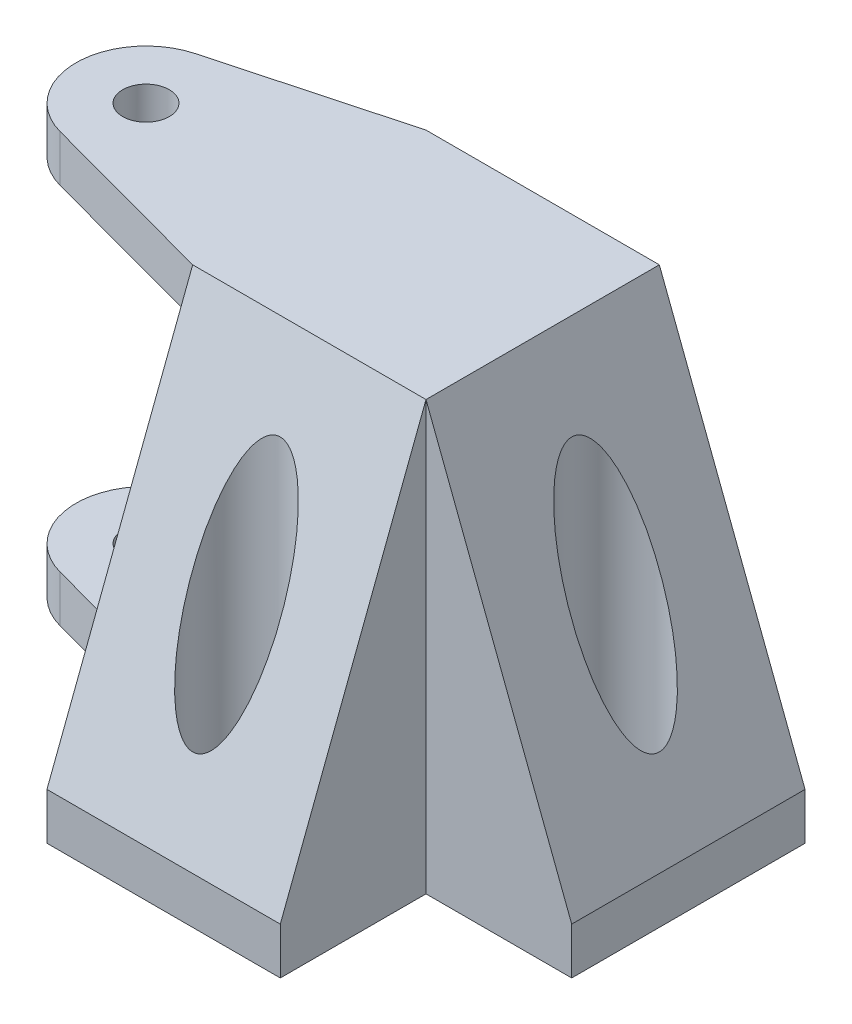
ISO-10303-21;
HEADER;
FILE_DESCRIPTION(('STEP AP214'),'2;1');
FILE_NAME('part.step','',(''),(''),'','','');
FILE_SCHEMA(('AUTOMOTIVE_DESIGN { 1 0 10303 214 1 1 1 1 }'));
ENDSEC;
DATA;
#1=APPLICATION_CONTEXT('core data for automotive mechanical design processes');
#2=APPLICATION_PROTOCOL_DEFINITION('international standard','automotive_design',2000,#1);
#3=PRODUCT_CONTEXT('',#1,'mechanical');
#4=PRODUCT('Part','Part','',(#3));
#5=PRODUCT_RELATED_PRODUCT_CATEGORY('part','',(#4));
#6=PRODUCT_DEFINITION_FORMATION('','',#4);
#7=PRODUCT_DEFINITION_CONTEXT('part definition',#1,'design');
#8=PRODUCT_DEFINITION('design','',#6,#7);
#9=PRODUCT_DEFINITION_SHAPE('','',#8);
#10=(LENGTH_UNIT() NAMED_UNIT(*) SI_UNIT(.MILLI.,.METRE.));
#11=(NAMED_UNIT(*) PLANE_ANGLE_UNIT() SI_UNIT($,.RADIAN.));
#12=(NAMED_UNIT(*) SI_UNIT($,.STERADIAN.) SOLID_ANGLE_UNIT());
#13=UNCERTAINTY_MEASURE_WITH_UNIT(LENGTH_MEASURE(1.E-05),#10,'distance_accuracy_value','');
#14=(GEOMETRIC_REPRESENTATION_CONTEXT(3) GLOBAL_UNCERTAINTY_ASSIGNED_CONTEXT((#13)) GLOBAL_UNIT_ASSIGNED_CONTEXT((#10,
#11,#12)) REPRESENTATION_CONTEXT('',''));
#15=CARTESIAN_POINT('',(0.,0.,0.));
#16=DIRECTION('',(0.,0.,1.));
#17=DIRECTION('',(1.,0.,0.));
#18=AXIS2_PLACEMENT_3D('',#15,#16,#17);
#19=CARTESIAN_POINT('',(-20.,0.,52.4890829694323));
#20=DIRECTION('',(0.,1.,0.));
#21=DIRECTION('',(0.,0.,1.));
#22=AXIS2_PLACEMENT_3D('',#19,#20,#21);
#23=CYLINDRICAL_SURFACE('',#22,4.);
#24=CARTESIAN_POINT('',(-20.,0.,52.4890829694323));
#25=DIRECTION('',(0.,1.,0.));
#26=DIRECTION('',(0.,0.,1.));
#27=AXIS2_PLACEMENT_3D('',#24,#25,#26);
#28=CIRCLE('',#27,4.);
#29=CARTESIAN_POINT('',(-20.,0.,56.4890829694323));
#30=VERTEX_POINT('',#29);
#31=EDGE_CURVE('E284',#30,#30,#28,.T.);
#32=ORIENTED_EDGE('',*,*,#31,.F.);
#33=EDGE_LOOP('',(#32));
#34=FACE_BOUND('',#33,.T.);
#35=CARTESIAN_POINT('',(-20.,5.,52.4890829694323));
#36=DIRECTION('',(0.,1.,0.));
#37=DIRECTION('',(0.,0.,1.));
#38=AXIS2_PLACEMENT_3D('',#35,#36,#37);
#39=CIRCLE('',#38,4.);
#40=CARTESIAN_POINT('',(-20.,5.,56.4890829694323));
#41=VERTEX_POINT('',#40);
#42=EDGE_CURVE('E268',#41,#41,#39,.F.);
#43=ORIENTED_EDGE('',*,*,#42,.F.);
#44=EDGE_LOOP('',(#43));
#45=FACE_BOUND('',#44,.T.);
#46=ADVANCED_FACE('F49',(#34,#45),#23,.F.);
#47=CARTESIAN_POINT('',(12.4890829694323,0.,20.));
#48=DIRECTION('',(0.,1.,0.));
#49=DIRECTION('',(0.,0.,1.));
#50=AXIS2_PLACEMENT_3D('',#47,#48,#49);
#51=CYLINDRICAL_SURFACE('',#50,4.);
#52=CARTESIAN_POINT('',(12.4890829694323,0.,20.));
#53=DIRECTION('',(0.,1.,0.));
#54=DIRECTION('',(0.,0.,1.));
#55=AXIS2_PLACEMENT_3D('',#52,#53,#54);
#56=CIRCLE('',#55,4.);
#57=CARTESIAN_POINT('',(12.4890829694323,0.,24.));
#58=VERTEX_POINT('',#57);
#59=EDGE_CURVE('E264',#58,#58,#56,.T.);
#60=ORIENTED_EDGE('',*,*,#59,.F.);
#61=EDGE_LOOP('',(#60));
#62=FACE_BOUND('',#61,.T.);
#63=CARTESIAN_POINT('',(12.4890829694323,5.,20.));
#64=DIRECTION('',(0.,1.,0.));
#65=DIRECTION('',(0.,0.,1.));
#66=AXIS2_PLACEMENT_3D('',#63,#64,#65);
#67=CIRCLE('',#66,4.);
#68=CARTESIAN_POINT('',(12.4890829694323,5.,24.));
#69=VERTEX_POINT('',#68);
#70=EDGE_CURVE('E265',#69,#69,#67,.F.);
#71=ORIENTED_EDGE('',*,*,#70,.F.);
#72=EDGE_LOOP('',(#71));
#73=FACE_BOUND('',#72,.T.);
#74=ADVANCED_FACE('F316',(#62,#73),#51,.F.);
#75=CARTESIAN_POINT('',(0.,0.,40.));
#76=DIRECTION('',(0.,0.,-1.));
#77=DIRECTION('',(-1.,0.,0.));
#78=AXIS2_PLACEMENT_3D('',#75,#76,#77);
#79=PLANE('',#78);
#80=DIRECTION('',(0.,1.,0.));
#81=VECTOR('',#80,1.);
#82=CARTESIAN_POINT('',(0.,73.3918284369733,40.));
#83=LINE('',#82,#81);
#84=CARTESIAN_POINT('',(0.,0.,40.));
#85=VERTEX_POINT('',#84);
#86=CARTESIAN_POINT('',(0.,73.3918284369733,40.));
#87=VERTEX_POINT('',#86);
#88=EDGE_CURVE('E66',#85,#87,#83,.T.);
#89=ORIENTED_EDGE('',*,*,#88,.F.);
#90=DIRECTION('',(1.,0.,0.));
#91=VECTOR('',#90,1.);
#92=CARTESIAN_POINT('',(0.,0.,40.));
#93=LINE('',#92,#91);
#94=CARTESIAN_POINT('',(24.9781659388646,0.,40.));
#95=VERTEX_POINT('',#94);
#96=EDGE_CURVE('E228',#85,#95,#93,.T.);
#97=ORIENTED_EDGE('',*,*,#96,.T.);
#98=DIRECTION('',(0.,1.,0.));
#99=VECTOR('',#98,1.);
#100=CARTESIAN_POINT('',(24.9781659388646,8.,40.));
#101=LINE('',#100,#99);
#102=CARTESIAN_POINT('',(24.9781659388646,8.,40.));
#103=VERTEX_POINT('',#102);
#104=EDGE_CURVE('E230',#95,#103,#101,.T.);
#105=ORIENTED_EDGE('',*,*,#104,.T.);
#106=DIRECTION('',(-0.35683094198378,0.934168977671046,0.));
#107=VECTOR('',#106,1.);
#108=CARTESIAN_POINT('',(0.,73.3918284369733,40.));
#109=LINE('',#108,#107);
#110=EDGE_CURVE('E233',#103,#87,#109,.T.);
#111=ORIENTED_EDGE('',*,*,#110,.T.);
#112=EDGE_LOOP('',(#89,#97,#105,#111));
#113=FACE_BOUND('',#112,.T.);
#114=ADVANCED_FACE('F322',(#113),#79,.F.);
#115=CARTESIAN_POINT('',(-40.,0.,40.));
#116=DIRECTION('',(0.260963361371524,0.,-0.965348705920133));
#117=DIRECTION('',(-0.965348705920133,0.,-0.260963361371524));
#118=AXIS2_PLACEMENT_3D('',#115,#116,#117);
#119=PLANE('',#118);
#120=DIRECTION('',(-0.965348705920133,0.,-0.260963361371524));
#121=VECTOR('',#120,1.);
#122=CARTESIAN_POINT('',(-40.,65.3918284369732,40.));
#123=LINE('',#122,#121);
#124=CARTESIAN_POINT('',(-40.,65.3918284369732,40.));
#125=VERTEX_POINT('',#124);
#126=CARTESIAN_POINT('',(-71.1315603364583,65.3918284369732,31.5841844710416));
#127=VERTEX_POINT('',#126);
#128=EDGE_CURVE('E201',#125,#127,#123,.T.);
#129=ORIENTED_EDGE('',*,*,#128,.F.);
#130=DIRECTION('',(0.,-1.,0.));
#131=VECTOR('',#130,1.);
#132=CARTESIAN_POINT('',(-40.,0.,40.));
#133=LINE('',#132,#131);
#134=CARTESIAN_POINT('',(-40.,73.3918284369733,40.));
#135=VERTEX_POINT('',#134);
#136=EDGE_CURVE('E237',#135,#125,#133,.T.);
#137=ORIENTED_EDGE('',*,*,#136,.F.);
#138=DIRECTION('',(-0.965348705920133,0.,-0.260963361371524));
#139=VECTOR('',#138,1.);
#140=CARTESIAN_POINT('',(-40.,73.3918284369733,40.));
#141=LINE('',#140,#139);
#142=CARTESIAN_POINT('',(-71.1315603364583,73.3918284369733,31.5841844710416));
#143=VERTEX_POINT('',#142);
#144=EDGE_CURVE('E203',#135,#143,#141,.T.);
#145=ORIENTED_EDGE('',*,*,#144,.T.);
#146=DIRECTION('',(0.,1.,0.));
#147=VECTOR('',#146,1.);
#148=CARTESIAN_POINT('',(-71.1315603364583,0.,31.5841844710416));
#149=LINE('',#148,#147);
#150=EDGE_CURVE('E223',#127,#143,#149,.T.);
#151=ORIENTED_EDGE('',*,*,#150,.F.);
#152=EDGE_LOOP('',(#129,#137,#145,#151));
#153=FACE_BOUND('',#152,.T.);
#154=ADVANCED_FACE('F360',(#153),#119,.F.);
#155=DIRECTION('',(0.965348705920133,0.,0.260963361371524));
#156=VECTOR('',#155,1.);
#157=CARTESIAN_POINT('',(-40.,8.,40.));
#158=LINE('',#157,#156);
#159=CARTESIAN_POINT('',(-71.1315603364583,8.,31.5841844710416));
#160=VERTEX_POINT('',#159);
#161=CARTESIAN_POINT('',(-40.,8.,40.));
#162=VERTEX_POINT('',#161);
#163=EDGE_CURVE('E197',#160,#162,#158,.T.);
#164=ORIENTED_EDGE('',*,*,#163,.F.);
#165=CARTESIAN_POINT('',(-71.1315603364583,0.,31.5841844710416));
#166=VERTEX_POINT('',#165);
#167=EDGE_CURVE('E224',#166,#160,#149,.T.);
#168=ORIENTED_EDGE('',*,*,#167,.F.);
#169=DIRECTION('',(-0.965348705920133,0.,-0.260963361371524));
#170=VECTOR('',#169,1.);
#171=CARTESIAN_POINT('',(-40.,0.,40.));
#172=LINE('',#171,#170);
#173=CARTESIAN_POINT('',(-40.,0.,40.));
#174=VERTEX_POINT('',#173);
#175=EDGE_CURVE('E204',#174,#166,#172,.T.);
#176=ORIENTED_EDGE('',*,*,#175,.F.);
#177=EDGE_CURVE('E236',#162,#174,#133,.T.);
#178=ORIENTED_EDGE('',*,*,#177,.F.);
#179=EDGE_LOOP('',(#164,#168,#176,#178));
#180=FACE_BOUND('',#179,.T.);
#181=ADVANCED_FACE('F358',(#180),#119,.F.);
#182=CARTESIAN_POINT('',(-68.,0.,20.));
#183=DIRECTION('',(0.,1.,0.));
#184=DIRECTION('',(0.,0.,1.));
#185=AXIS2_PLACEMENT_3D('',#182,#183,#184);
#186=CYLINDRICAL_SURFACE('',#185,12.);
#187=DIRECTION('',(0.,1.,0.));
#188=VECTOR('',#187,1.);
#189=CARTESIAN_POINT('',(-71.1315603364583,0.,8.41581552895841));
#190=LINE('',#189,#188);
#191=CARTESIAN_POINT('',(-71.1315603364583,65.3918284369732,8.41581552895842));
#192=VERTEX_POINT('',#191);
#193=CARTESIAN_POINT('',(-71.1315603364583,73.3918284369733,8.41581552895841));
#194=VERTEX_POINT('',#193);
#195=EDGE_CURVE('E212',#192,#194,#190,.T.);
#196=ORIENTED_EDGE('',*,*,#195,.F.);
#197=CARTESIAN_POINT('',(-68.,65.3918284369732,20.));
#198=DIRECTION('',(0.,-1.,0.));
#199=DIRECTION('',(0.,0.,-1.));
#200=AXIS2_PLACEMENT_3D('',#197,#198,#199);
#201=CIRCLE('',#200,12.);
#202=EDGE_CURVE('E199',#127,#192,#201,.T.);
#203=ORIENTED_EDGE('',*,*,#202,.F.);
#204=ORIENTED_EDGE('',*,*,#150,.T.);
#205=CARTESIAN_POINT('',(-68.,73.3918284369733,20.));
#206=DIRECTION('',(0.,-1.,0.));
#207=DIRECTION('',(0.,0.,-1.));
#208=AXIS2_PLACEMENT_3D('',#205,#206,#207);
#209=CIRCLE('',#208,12.);
#210=EDGE_CURVE('E215',#143,#194,#209,.T.);
#211=ORIENTED_EDGE('',*,*,#210,.T.);
#212=EDGE_LOOP('',(#196,#203,#204,#211));
#213=FACE_BOUND('',#212,.T.);
#214=ADVANCED_FACE('F355',(#213),#186,.T.);
#215=CARTESIAN_POINT('',(-68.,8.,20.));
#216=DIRECTION('',(0.,1.,0.));
#217=DIRECTION('',(-1.,0.,0.));
#218=AXIS2_PLACEMENT_3D('',#215,#216,#217);
#219=CIRCLE('',#218,12.);
#220=CARTESIAN_POINT('',(-71.1315603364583,8.,8.41581552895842));
#221=VERTEX_POINT('',#220);
#222=EDGE_CURVE('E195',#221,#160,#219,.T.);
#223=ORIENTED_EDGE('',*,*,#222,.F.);
#224=CARTESIAN_POINT('',(-71.1315603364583,0.,8.41581552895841));
#225=VERTEX_POINT('',#224);
#226=EDGE_CURVE('E220',#225,#221,#190,.T.);
#227=ORIENTED_EDGE('',*,*,#226,.F.);
#228=CARTESIAN_POINT('',(-68.,0.,20.));
#229=DIRECTION('',(0.,-1.,0.));
#230=DIRECTION('',(0.,0.,-1.));
#231=AXIS2_PLACEMENT_3D('',#228,#229,#230);
#232=CIRCLE('',#231,12.);
#233=EDGE_CURVE('E206',#166,#225,#232,.T.);
#234=ORIENTED_EDGE('',*,*,#233,.F.);
#235=ORIENTED_EDGE('',*,*,#167,.T.);
#236=EDGE_LOOP('',(#223,#227,#234,#235));
#237=FACE_BOUND('',#236,.T.);
#238=ADVANCED_FACE('F353',(#237),#186,.T.);
#239=CARTESIAN_POINT('',(-40.,0.,0.));
#240=DIRECTION('',(-0.260963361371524,0.,-0.965348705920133));
#241=DIRECTION('',(-0.965348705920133,0.,0.260963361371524));
#242=AXIS2_PLACEMENT_3D('',#239,#240,#241);
#243=PLANE('',#242);
#244=DIRECTION('',(0.,-1.,0.));
#245=VECTOR('',#244,1.);
#246=CARTESIAN_POINT('',(-40.,0.,0.));
#247=LINE('',#246,#245);
#248=CARTESIAN_POINT('',(-40.,73.3918284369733,0.));
#249=VERTEX_POINT('',#248);
#250=CARTESIAN_POINT('',(-40.,65.3918284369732,0.));
#251=VERTEX_POINT('',#250);
#252=EDGE_CURVE('E247',#249,#251,#247,.T.);
#253=ORIENTED_EDGE('',*,*,#252,.T.);
#254=DIRECTION('',(-0.965348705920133,0.,0.260963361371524));
#255=VECTOR('',#254,1.);
#256=CARTESIAN_POINT('',(-40.,65.3918284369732,0.));
#257=LINE('',#256,#255);
#258=EDGE_CURVE('E11',#251,#192,#257,.T.);
#259=ORIENTED_EDGE('',*,*,#258,.T.);
#260=ORIENTED_EDGE('',*,*,#195,.T.);
#261=DIRECTION('',(-0.965348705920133,0.,0.260963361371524));
#262=VECTOR('',#261,1.);
#263=CARTESIAN_POINT('',(-40.,73.3918284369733,0.));
#264=LINE('',#263,#262);
#265=EDGE_CURVE('E207',#249,#194,#264,.T.);
#266=ORIENTED_EDGE('',*,*,#265,.F.);
#267=EDGE_LOOP('',(#253,#259,#260,#266));
#268=FACE_BOUND('',#267,.T.);
#269=ADVANCED_FACE('F349',(#268),#243,.T.);
#270=ORIENTED_EDGE('',*,*,#226,.T.);
#271=DIRECTION('',(0.965348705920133,0.,-0.260963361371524));
#272=VECTOR('',#271,1.);
#273=CARTESIAN_POINT('',(-40.,8.,0.));
#274=LINE('',#273,#272);
#275=CARTESIAN_POINT('',(-40.,8.,0.));
#276=VERTEX_POINT('',#275);
#277=EDGE_CURVE('E58',#221,#276,#274,.T.);
#278=ORIENTED_EDGE('',*,*,#277,.T.);
#279=CARTESIAN_POINT('',(-40.,0.,0.));
#280=VERTEX_POINT('',#279);
#281=EDGE_CURVE('E246',#276,#280,#247,.T.);
#282=ORIENTED_EDGE('',*,*,#281,.T.);
#283=DIRECTION('',(-0.965348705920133,0.,0.260963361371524));
#284=VECTOR('',#283,1.);
#285=CARTESIAN_POINT('',(-40.,0.,0.));
#286=LINE('',#285,#284);
#287=EDGE_CURVE('E209',#280,#225,#286,.T.);
#288=ORIENTED_EDGE('',*,*,#287,.T.);
#289=EDGE_LOOP('',(#270,#278,#282,#288));
#290=FACE_BOUND('',#289,.T.);
#291=ADVANCED_FACE('F352',(#290),#243,.T.);
#292=CARTESIAN_POINT('',(24.9781659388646,8.,40.));
#293=DIRECTION('',(-1.,0.,0.));
#294=DIRECTION('',(0.,-1.,0.));
#295=AXIS2_PLACEMENT_3D('',#292,#293,#294);
#296=PLANE('',#295);
#297=DIRECTION('',(0.,1.,0.));
#298=VECTOR('',#297,1.);
#299=CARTESIAN_POINT('',(24.9781659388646,8.,0.));
#300=LINE('',#299,#298);
#301=CARTESIAN_POINT('',(24.9781659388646,0.,0.));
#302=VERTEX_POINT('',#301);
#303=CARTESIAN_POINT('',(24.9781659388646,8.,0.));
#304=VERTEX_POINT('',#303);
#305=EDGE_CURVE('E227',#302,#304,#300,.T.);
#306=ORIENTED_EDGE('',*,*,#305,.T.);
#307=DIRECTION('',(0.,0.,-1.));
#308=VECTOR('',#307,1.);
#309=CARTESIAN_POINT('',(24.9781659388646,8.,40.));
#310=LINE('',#309,#308);
#311=EDGE_CURVE('E253',#103,#304,#310,.T.);
#312=ORIENTED_EDGE('',*,*,#311,.F.);
#313=ORIENTED_EDGE('',*,*,#104,.F.);
#314=DIRECTION('',(0.,0.,-1.));
#315=VECTOR('',#314,1.);
#316=CARTESIAN_POINT('',(24.9781659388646,0.,40.));
#317=LINE('',#316,#315);
#318=EDGE_CURVE('E256',#95,#302,#317,.T.);
#319=ORIENTED_EDGE('',*,*,#318,.T.);
#320=EDGE_LOOP('',(#306,#312,#313,#319));
#321=FACE_BOUND('',#320,.T.);
#322=ADVANCED_FACE('F51',(#321),#296,.F.);
#323=CARTESIAN_POINT('',(0.,73.3918284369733,40.));
#324=DIRECTION('',(-0.934168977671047,-0.35683094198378,0.));
#325=DIRECTION('',(0.35683094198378,-0.934168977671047,0.));
#326=AXIS2_PLACEMENT_3D('',#323,#324,#325);
#327=PLANE('',#326);
#328=CARTESIAN_POINT('',(12.4890829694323,40.6959142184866,20.));
#329=DIRECTION('',(-0.934168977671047,-0.35683094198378,0.));
#330=DIRECTION('',(0.35683094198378,-0.934168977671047,0.));
#331=AXIS2_PLACEMENT_3D('',#328,#329,#330);
#332=ELLIPSE('',#331,21.0183566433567,7.5);
#333=CARTESIAN_POINT('',(19.9890829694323,21.0612174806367,20.));
#334=VERTEX_POINT('',#333);
#335=EDGE_CURVE('E53',#334,#334,#332,.F.);
#336=ORIENTED_EDGE('',*,*,#335,.F.);
#337=EDGE_LOOP('',(#336));
#338=FACE_BOUND('',#337,.T.);
#339=DIRECTION('',(-0.35683094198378,0.934168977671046,0.));
#340=VECTOR('',#339,1.);
#341=CARTESIAN_POINT('',(0.,73.3918284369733,0.));
#342=LINE('',#341,#340);
#343=CARTESIAN_POINT('',(0.,73.3918284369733,0.));
#344=VERTEX_POINT('',#343);
#345=EDGE_CURVE('E241',#304,#344,#342,.T.);
#346=ORIENTED_EDGE('',*,*,#345,.T.);
#347=DIRECTION('',(0.,0.,-1.));
#348=VECTOR('',#347,1.);
#349=CARTESIAN_POINT('',(0.,73.3918284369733,40.));
#350=LINE('',#349,#348);
#351=EDGE_CURVE('E239',#87,#344,#350,.T.);
#352=ORIENTED_EDGE('',*,*,#351,.F.);
#353=ORIENTED_EDGE('',*,*,#110,.F.);
#354=ORIENTED_EDGE('',*,*,#311,.T.);
#355=EDGE_LOOP('',(#346,#352,#353,#354));
#356=FACE_BOUND('',#355,.T.);
#357=ADVANCED_FACE('F375',(#338,#356),#327,.F.);
#358=CARTESIAN_POINT('',(-40.,73.3918284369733,40.));
#359=DIRECTION('',(0.,-1.,0.));
#360=DIRECTION('',(0.,0.,-1.));
#361=AXIS2_PLACEMENT_3D('',#358,#359,#360);
#362=PLANE('',#361);
#363=CARTESIAN_POINT('',(-68.,73.3918284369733,20.));
#364=DIRECTION('',(0.,1.,0.));
#365=DIRECTION('',(0.,0.,1.));
#366=AXIS2_PLACEMENT_3D('',#363,#364,#365);
#367=CIRCLE('',#366,4.00000000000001);
#368=CARTESIAN_POINT('',(-68.,73.3918284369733,24.));
#369=VERTEX_POINT('',#368);
#370=EDGE_CURVE('E280',#369,#369,#367,.T.);
#371=ORIENTED_EDGE('',*,*,#370,.F.);
#372=EDGE_LOOP('',(#371));
#373=FACE_BOUND('',#372,.T.);
#374=DIRECTION('',(-1.,0.,0.));
#375=VECTOR('',#374,1.);
#376=CARTESIAN_POINT('',(-40.,73.3918284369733,0.));
#377=LINE('',#376,#375);
#378=EDGE_CURVE('E243',#344,#249,#377,.T.);
#379=ORIENTED_EDGE('',*,*,#378,.T.);
#380=ORIENTED_EDGE('',*,*,#265,.T.);
#381=ORIENTED_EDGE('',*,*,#210,.F.);
#382=ORIENTED_EDGE('',*,*,#144,.F.);
#383=DIRECTION('',(-1.,0.,0.));
#384=VECTOR('',#383,1.);
#385=CARTESIAN_POINT('',(-40.,73.3918284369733,40.));
#386=LINE('',#385,#384);
#387=EDGE_CURVE('E174',#87,#135,#386,.T.);
#388=ORIENTED_EDGE('',*,*,#387,.F.);
#389=ORIENTED_EDGE('',*,*,#351,.T.);
#390=EDGE_LOOP('',(#379,#380,#381,#382,#388,#389));
#391=FACE_BOUND('',#390,.T.);
#392=ADVANCED_FACE('F372',(#373,#391),#362,.F.);
#393=CARTESIAN_POINT('',(0.,0.,40.));
#394=DIRECTION('',(0.,1.,0.));
#395=DIRECTION('',(0.,0.,1.));
#396=AXIS2_PLACEMENT_3D('',#393,#394,#395);
#397=PLANE('',#396);
#398=ORIENTED_EDGE('',*,*,#59,.T.);
#399=EDGE_LOOP('',(#398));
#400=FACE_BOUND('',#399,.T.);
#401=ORIENTED_EDGE('',*,*,#31,.T.);
#402=EDGE_LOOP('',(#401));
#403=FACE_BOUND('',#402,.T.);
#404=CARTESIAN_POINT('',(-68.,0.,20.));
#405=DIRECTION('',(0.,1.,0.));
#406=DIRECTION('',(0.,0.,1.));
#407=AXIS2_PLACEMENT_3D('',#404,#405,#406);
#408=CIRCLE('',#407,4.00000000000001);
#409=CARTESIAN_POINT('',(-68.,0.,24.));
#410=VERTEX_POINT('',#409);
#411=EDGE_CURVE('E276',#410,#410,#408,.T.);
#412=ORIENTED_EDGE('',*,*,#411,.T.);
#413=EDGE_LOOP('',(#412));
#414=FACE_BOUND('',#413,.T.);
#415=DIRECTION('',(1.,0.,0.));
#416=VECTOR('',#415,1.);
#417=CARTESIAN_POINT('',(0.,0.,0.));
#418=LINE('',#417,#416);
#419=EDGE_CURVE('E231',#280,#302,#418,.T.);
#420=ORIENTED_EDGE('',*,*,#419,.T.);
#421=ORIENTED_EDGE('',*,*,#318,.F.);
#422=ORIENTED_EDGE('',*,*,#96,.F.);
#423=DIRECTION('',(0.,0.,-1.));
#424=VECTOR('',#423,1.);
#425=CARTESIAN_POINT('',(0.,0.,64.9781659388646));
#426=LINE('',#425,#424);
#427=CARTESIAN_POINT('',(0.,0.,64.9781659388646));
#428=VERTEX_POINT('',#427);
#429=EDGE_CURVE('E175',#428,#85,#426,.T.);
#430=ORIENTED_EDGE('',*,*,#429,.F.);
#431=DIRECTION('',(1.,0.,0.));
#432=VECTOR('',#431,1.);
#433=CARTESIAN_POINT('',(-40.,0.,64.9781659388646));
#434=LINE('',#433,#432);
#435=CARTESIAN_POINT('',(-40.,0.,64.9781659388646));
#436=VERTEX_POINT('',#435);
#437=EDGE_CURVE('E162',#436,#428,#434,.T.);
#438=ORIENTED_EDGE('',*,*,#437,.F.);
#439=DIRECTION('',(0.,0.,-1.));
#440=VECTOR('',#439,1.);
#441=CARTESIAN_POINT('',(-40.,0.,64.9781659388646));
#442=LINE('',#441,#440);
#443=EDGE_CURVE('E163',#436,#174,#442,.T.);
#444=ORIENTED_EDGE('',*,*,#443,.T.);
#445=ORIENTED_EDGE('',*,*,#175,.T.);
#446=ORIENTED_EDGE('',*,*,#233,.T.);
#447=ORIENTED_EDGE('',*,*,#287,.F.);
#448=EDGE_LOOP('',(#420,#421,#422,#430,#438,#444,#445,#446,#447));
#449=FACE_BOUND('',#448,.T.);
#450=ADVANCED_FACE('F368',(#400,#403,#414,#449),#397,.F.);
#451=CARTESIAN_POINT('',(0.,0.,0.));
#452=DIRECTION('',(0.,0.,-1.));
#453=DIRECTION('',(-1.,0.,0.));
#454=AXIS2_PLACEMENT_3D('',#451,#452,#453);
#455=PLANE('',#454);
#456=ORIENTED_EDGE('',*,*,#305,.F.);
#457=ORIENTED_EDGE('',*,*,#419,.F.);
#458=ORIENTED_EDGE('',*,*,#281,.F.);
#459=DIRECTION('',(0.,1.,0.));
#460=VECTOR('',#459,1.);
#461=CARTESIAN_POINT('',(-40.,8.,0.));
#462=LINE('',#461,#460);
#463=EDGE_CURVE('E188',#276,#251,#462,.T.);
#464=ORIENTED_EDGE('',*,*,#463,.T.);
#465=ORIENTED_EDGE('',*,*,#252,.F.);
#466=ORIENTED_EDGE('',*,*,#378,.F.);
#467=ORIENTED_EDGE('',*,*,#345,.F.);
#468=EDGE_LOOP('',(#456,#457,#458,#464,#465,#466,#467));
#469=FACE_BOUND('',#468,.T.);
#470=ADVANCED_FACE('F347',(#469),#455,.T.);
#471=CARTESIAN_POINT('',(-40.,65.3918284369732,73.));
#472=DIRECTION('',(0.,-1.,0.));
#473=DIRECTION('',(0.,0.,-1.));
#474=AXIS2_PLACEMENT_3D('',#471,#472,#473);
#475=PLANE('',#474);
#476=CARTESIAN_POINT('',(-68.,65.3918284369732,20.));
#477=DIRECTION('',(0.,-1.,0.));
#478=DIRECTION('',(0.,0.,-1.));
#479=AXIS2_PLACEMENT_3D('',#476,#477,#478);
#480=CIRCLE('',#479,4.00000000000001);
#481=CARTESIAN_POINT('',(-68.,65.3918284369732,16.));
#482=VERTEX_POINT('',#481);
#483=EDGE_CURVE('E180',#482,#482,#480,.T.);
#484=ORIENTED_EDGE('',*,*,#483,.F.);
#485=EDGE_LOOP('',(#484));
#486=FACE_BOUND('',#485,.T.);
#487=ORIENTED_EDGE('',*,*,#128,.T.);
#488=ORIENTED_EDGE('',*,*,#202,.T.);
#489=ORIENTED_EDGE('',*,*,#258,.F.);
#490=DIRECTION('',(0.,0.,-1.));
#491=VECTOR('',#490,1.);
#492=CARTESIAN_POINT('',(-40.,65.3918284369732,73.));
#493=LINE('',#492,#491);
#494=EDGE_CURVE('E74',#125,#251,#493,.T.);
#495=ORIENTED_EDGE('',*,*,#494,.F.);
#496=EDGE_LOOP('',(#487,#488,#489,#495));
#497=FACE_BOUND('',#496,.T.);
#498=ADVANCED_FACE('F343',(#486,#497),#475,.T.);
#499=CARTESIAN_POINT('',(-80.,8.,73.));
#500=DIRECTION('',(0.,1.,0.));
#501=DIRECTION('',(-1.,0.,0.));
#502=AXIS2_PLACEMENT_3D('',#499,#500,#501);
#503=PLANE('',#502);
#504=CARTESIAN_POINT('',(-68.,8.,20.));
#505=DIRECTION('',(0.,1.,0.));
#506=DIRECTION('',(-1.,0.,0.));
#507=AXIS2_PLACEMENT_3D('',#504,#505,#506);
#508=CIRCLE('',#507,4.00000000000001);
#509=CARTESIAN_POINT('',(-72.,8.,20.));
#510=VERTEX_POINT('',#509);
#511=EDGE_CURVE('E261',#510,#510,#508,.T.);
#512=ORIENTED_EDGE('',*,*,#511,.F.);
#513=EDGE_LOOP('',(#512));
#514=FACE_BOUND('',#513,.T.);
#515=ORIENTED_EDGE('',*,*,#163,.T.);
#516=DIRECTION('',(0.,0.,-1.));
#517=VECTOR('',#516,1.);
#518=CARTESIAN_POINT('',(-40.,8.,73.));
#519=LINE('',#518,#517);
#520=EDGE_CURVE('E193',#162,#276,#519,.T.);
#521=ORIENTED_EDGE('',*,*,#520,.T.);
#522=ORIENTED_EDGE('',*,*,#277,.F.);
#523=ORIENTED_EDGE('',*,*,#222,.T.);
#524=EDGE_LOOP('',(#515,#521,#522,#523));
#525=FACE_BOUND('',#524,.T.);
#526=ADVANCED_FACE('F340',(#514,#525),#503,.T.);
#527=CARTESIAN_POINT('',(-40.,8.,73.));
#528=DIRECTION('',(-1.,0.,0.));
#529=DIRECTION('',(0.,0.,1.));
#530=AXIS2_PLACEMENT_3D('',#527,#528,#529);
#531=PLANE('',#530);
#532=ORIENTED_EDGE('',*,*,#520,.F.);
#533=ORIENTED_EDGE('',*,*,#177,.T.);
#534=ORIENTED_EDGE('',*,*,#443,.F.);
#535=DIRECTION('',(0.,-1.,0.));
#536=VECTOR('',#535,1.);
#537=CARTESIAN_POINT('',(-40.,8.,64.9781659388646));
#538=LINE('',#537,#536);
#539=CARTESIAN_POINT('',(-40.,8.,64.9781659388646));
#540=VERTEX_POINT('',#539);
#541=EDGE_CURVE('E154',#540,#436,#538,.T.);
#542=ORIENTED_EDGE('',*,*,#541,.F.);
#543=DIRECTION('',(0.,-0.934168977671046,0.356830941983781));
#544=VECTOR('',#543,1.);
#545=CARTESIAN_POINT('',(-40.,73.3918284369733,40.));
#546=LINE('',#545,#544);
#547=EDGE_CURVE('E168',#135,#540,#546,.T.);
#548=ORIENTED_EDGE('',*,*,#547,.F.);
#549=ORIENTED_EDGE('',*,*,#136,.T.);
#550=ORIENTED_EDGE('',*,*,#494,.T.);
#551=ORIENTED_EDGE('',*,*,#463,.F.);
#552=EDGE_LOOP('',(#532,#533,#534,#542,#548,#549,#550,#551));
#553=FACE_BOUND('',#552,.T.);
#554=ADVANCED_FACE('F167',(#553),#531,.T.);
#555=CARTESIAN_POINT('',(-40.,8.,64.9781659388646));
#556=DIRECTION('',(0.,0.,1.));
#557=DIRECTION('',(1.,0.,0.));
#558=AXIS2_PLACEMENT_3D('',#555,#556,#557);
#559=PLANE('',#558);
#560=DIRECTION('',(0.,-1.,0.));
#561=VECTOR('',#560,1.);
#562=CARTESIAN_POINT('',(0.,8.,64.9781659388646));
#563=LINE('',#562,#561);
#564=CARTESIAN_POINT('',(0.,8.,64.9781659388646));
#565=VERTEX_POINT('',#564);
#566=EDGE_CURVE('E157',#565,#428,#563,.T.);
#567=ORIENTED_EDGE('',*,*,#566,.F.);
#568=DIRECTION('',(1.,0.,0.));
#569=VECTOR('',#568,1.);
#570=CARTESIAN_POINT('',(-40.,8.,64.9781659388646));
#571=LINE('',#570,#569);
#572=EDGE_CURVE('E151',#540,#565,#571,.T.);
#573=ORIENTED_EDGE('',*,*,#572,.F.);
#574=ORIENTED_EDGE('',*,*,#541,.T.);
#575=ORIENTED_EDGE('',*,*,#437,.T.);
#576=EDGE_LOOP('',(#567,#573,#574,#575));
#577=FACE_BOUND('',#576,.T.);
#578=ADVANCED_FACE('F153',(#577),#559,.T.);
#579=CARTESIAN_POINT('',(-40.,73.3918284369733,40.));
#580=DIRECTION('',(0.,0.356830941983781,0.934168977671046));
#581=DIRECTION('',(0.,-0.934168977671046,0.356830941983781));
#582=AXIS2_PLACEMENT_3D('',#579,#580,#581);
#583=PLANE('',#582);
#584=CARTESIAN_POINT('',(-20.,40.6959142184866,52.4890829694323));
#585=DIRECTION('',(0.,0.356830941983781,0.934168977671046));
#586=DIRECTION('',(0.,-0.934168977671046,0.356830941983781));
#587=AXIS2_PLACEMENT_3D('',#584,#585,#586);
#588=ELLIPSE('',#587,21.0183566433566,7.5);
#589=CARTESIAN_POINT('',(-20.,21.0612174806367,59.9890829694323));
#590=VERTEX_POINT('',#589);
#591=EDGE_CURVE('E271',#590,#590,#588,.F.);
#592=ORIENTED_EDGE('',*,*,#591,.T.);
#593=EDGE_LOOP('',(#592));
#594=FACE_BOUND('',#593,.T.);
#595=DIRECTION('',(0.,-0.934168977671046,0.356830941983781));
#596=VECTOR('',#595,1.);
#597=CARTESIAN_POINT('',(0.,73.3918284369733,40.));
#598=LINE('',#597,#596);
#599=EDGE_CURVE('E185',#87,#565,#598,.T.);
#600=ORIENTED_EDGE('',*,*,#599,.F.);
#601=ORIENTED_EDGE('',*,*,#387,.T.);
#602=ORIENTED_EDGE('',*,*,#547,.T.);
#603=ORIENTED_EDGE('',*,*,#572,.T.);
#604=EDGE_LOOP('',(#600,#601,#602,#603));
#605=FACE_BOUND('',#604,.T.);
#606=ADVANCED_FACE('F173',(#594,#605),#583,.T.);
#607=CARTESIAN_POINT('',(0.,0.,0.));
#608=DIRECTION('',(1.,0.,0.));
#609=DIRECTION('',(0.,0.,-1.));
#610=AXIS2_PLACEMENT_3D('',#607,#608,#609);
#611=PLANE('',#610);
#612=ORIENTED_EDGE('',*,*,#88,.T.);
#613=ORIENTED_EDGE('',*,*,#599,.T.);
#614=ORIENTED_EDGE('',*,*,#566,.T.);
#615=ORIENTED_EDGE('',*,*,#429,.T.);
#616=EDGE_LOOP('',(#612,#613,#614,#615));
#617=FACE_BOUND('',#616,.T.);
#618=ADVANCED_FACE('F330',(#617),#611,.T.);
#619=CARTESIAN_POINT('',(-68.,0.,20.));
#620=DIRECTION('',(0.,1.,0.));
#621=DIRECTION('',(0.,0.,1.));
#622=AXIS2_PLACEMENT_3D('',#619,#620,#621);
#623=CYLINDRICAL_SURFACE('',#622,4.00000000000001);
#624=ORIENTED_EDGE('',*,*,#511,.T.);
#625=EDGE_LOOP('',(#624));
#626=FACE_BOUND('',#625,.T.);
#627=ORIENTED_EDGE('',*,*,#411,.F.);
#628=EDGE_LOOP('',(#627));
#629=FACE_BOUND('',#628,.T.);
#630=ADVANCED_FACE('F311',(#626,#629),#623,.F.);
#631=ORIENTED_EDGE('',*,*,#483,.T.);
#632=EDGE_LOOP('',(#631));
#633=FACE_BOUND('',#632,.T.);
#634=ORIENTED_EDGE('',*,*,#370,.T.);
#635=EDGE_LOOP('',(#634));
#636=FACE_BOUND('',#635,.T.);
#637=ADVANCED_FACE('F302',(#633,#636),#623,.F.);
#638=CARTESIAN_POINT('',(12.4890829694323,73.3918284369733,20.));
#639=DIRECTION('',(0.,-1.,0.));
#640=DIRECTION('',(0.,0.,-1.));
#641=AXIS2_PLACEMENT_3D('',#638,#639,#640);
#642=CYLINDRICAL_SURFACE('',#641,7.5);
#643=CARTESIAN_POINT('',(12.4890829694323,5.,20.));
#644=DIRECTION('',(0.,1.,0.));
#645=DIRECTION('',(0.,0.,1.));
#646=AXIS2_PLACEMENT_3D('',#643,#644,#645);
#647=CIRCLE('',#646,7.5);
#648=CARTESIAN_POINT('',(12.4890829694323,5.,27.5));
#649=VERTEX_POINT('',#648);
#650=EDGE_CURVE('E269',#649,#649,#647,.T.);
#651=ORIENTED_EDGE('',*,*,#650,.F.);
#652=EDGE_LOOP('',(#651));
#653=FACE_BOUND('',#652,.T.);
#654=ORIENTED_EDGE('',*,*,#335,.T.);
#655=EDGE_LOOP('',(#654));
#656=FACE_BOUND('',#655,.T.);
#657=ADVANCED_FACE('F300',(#653,#656),#642,.F.);
#658=CARTESIAN_POINT('',(12.4890829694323,5.,20.));
#659=DIRECTION('',(0.,1.,0.));
#660=DIRECTION('',(0.,0.,1.));
#661=AXIS2_PLACEMENT_3D('',#658,#659,#660);
#662=PLANE('',#661);
#663=ORIENTED_EDGE('',*,*,#650,.T.);
#664=EDGE_LOOP('',(#663));
#665=FACE_BOUND('',#664,.T.);
#666=ORIENTED_EDGE('',*,*,#70,.T.);
#667=EDGE_LOOP('',(#666));
#668=FACE_BOUND('',#667,.T.);
#669=ADVANCED_FACE('F297',(#665,#668),#662,.T.);
#670=CARTESIAN_POINT('',(-20.,5.,52.4890829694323));
#671=DIRECTION('',(0.,1.,0.));
#672=DIRECTION('',(0.,0.,1.));
#673=AXIS2_PLACEMENT_3D('',#670,#671,#672);
#674=PLANE('',#673);
#675=CARTESIAN_POINT('',(-20.,5.,52.4890829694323));
#676=DIRECTION('',(0.,1.,0.));
#677=DIRECTION('',(0.,0.,1.));
#678=AXIS2_PLACEMENT_3D('',#675,#676,#677);
#679=CIRCLE('',#678,7.5);
#680=CARTESIAN_POINT('',(-20.,5.,59.9890829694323));
#681=VERTEX_POINT('',#680);
#682=EDGE_CURVE('E291',#681,#681,#679,.T.);
#683=ORIENTED_EDGE('',*,*,#682,.T.);
#684=EDGE_LOOP('',(#683));
#685=FACE_BOUND('',#684,.T.);
#686=ORIENTED_EDGE('',*,*,#42,.T.);
#687=EDGE_LOOP('',(#686));
#688=FACE_BOUND('',#687,.T.);
#689=ADVANCED_FACE('F308',(#685,#688),#674,.T.);
#690=CARTESIAN_POINT('',(-20.,73.3918284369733,52.4890829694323));
#691=DIRECTION('',(0.,-1.,0.));
#692=DIRECTION('',(0.,0.,-1.));
#693=AXIS2_PLACEMENT_3D('',#690,#691,#692);
#694=CYLINDRICAL_SURFACE('',#693,7.5);
#695=ORIENTED_EDGE('',*,*,#591,.F.);
#696=EDGE_LOOP('',(#695));
#697=FACE_BOUND('',#696,.T.);
#698=ORIENTED_EDGE('',*,*,#682,.F.);
#699=EDGE_LOOP('',(#698));
#700=FACE_BOUND('',#699,.T.);
#701=ADVANCED_FACE('F525',(#697,#700),#694,.F.);
#702=CLOSED_SHELL('',(#46,#74,#114,#154,#181,#214,#238,#269,#291,#322,#357,#392,#450,#470,#498,
#526,#554,#578,#606,#618,#630,#637,#657,#669,#689,#701));
#703=MANIFOLD_SOLID_BREP('B2',#702);
#704=ADVANCED_BREP_SHAPE_REPRESENTATION('',(#18,#703),#14);
#705=SHAPE_DEFINITION_REPRESENTATION(#9,#704);
ENDSEC;
END-ISO-10303-21;
